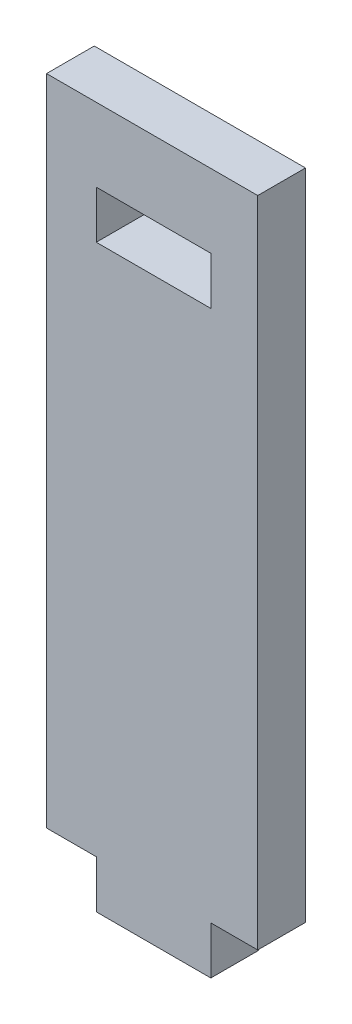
ISO-10303-21;
HEADER;
FILE_DESCRIPTION(('STEP AP214'),'2;1');
FILE_NAME('part.step','',(''),(''),'','','');
FILE_SCHEMA(('AUTOMOTIVE_DESIGN { 1 0 10303 214 1 1 1 1 }'));
ENDSEC;
DATA;
#1=APPLICATION_CONTEXT('core data for automotive mechanical design processes');
#2=APPLICATION_PROTOCOL_DEFINITION('international standard','automotive_design',2000,#1);
#3=PRODUCT_CONTEXT('',#1,'mechanical');
#4=PRODUCT('Part','Part','',(#3));
#5=PRODUCT_RELATED_PRODUCT_CATEGORY('part','',(#4));
#6=PRODUCT_DEFINITION_FORMATION('','',#4);
#7=PRODUCT_DEFINITION_CONTEXT('part definition',#1,'design');
#8=PRODUCT_DEFINITION('design','',#6,#7);
#9=PRODUCT_DEFINITION_SHAPE('','',#8);
#10=(LENGTH_UNIT() NAMED_UNIT(*) SI_UNIT(.MILLI.,.METRE.));
#11=(NAMED_UNIT(*) PLANE_ANGLE_UNIT() SI_UNIT($,.RADIAN.));
#12=(NAMED_UNIT(*) SI_UNIT($,.STERADIAN.) SOLID_ANGLE_UNIT());
#13=UNCERTAINTY_MEASURE_WITH_UNIT(LENGTH_MEASURE(1.E-05),#10,'distance_accuracy_value','');
#14=(GEOMETRIC_REPRESENTATION_CONTEXT(3) GLOBAL_UNCERTAINTY_ASSIGNED_CONTEXT((#13)) GLOBAL_UNIT_ASSIGNED_CONTEXT((#10,
#11,#12)) REPRESENTATION_CONTEXT('',''));
#15=CARTESIAN_POINT('',(0.,0.,0.));
#16=DIRECTION('',(0.,0.,1.));
#17=DIRECTION('',(1.,0.,0.));
#18=AXIS2_PLACEMENT_3D('',#15,#16,#17);
#19=CARTESIAN_POINT('',(0.,0.,5.));
#20=DIRECTION('',(0.,0.,1.));
#21=DIRECTION('',(1.,0.,0.));
#22=AXIS2_PLACEMENT_3D('',#19,#20,#21);
#23=PLANE('',#22);
#24=DIRECTION('',(0.,-1.,0.));
#25=VECTOR('',#24,1.);
#26=CARTESIAN_POINT('',(-17.479999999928,53.1273704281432,5.));
#27=LINE('',#26,#25);
#28=CARTESIAN_POINT('',(-17.479999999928,53.1273704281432,5.));
#29=VERTEX_POINT('',#28);
#30=CARTESIAN_POINT('',(-17.479999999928,-15.3125,5.));
#31=VERTEX_POINT('',#30);
#32=EDGE_CURVE('E162',#29,#31,#27,.T.);
#33=ORIENTED_EDGE('',*,*,#32,.T.);
#34=DIRECTION('',(1.,0.,0.));
#35=VECTOR('',#34,1.);
#36=CARTESIAN_POINT('',(-17.479999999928,-15.3125,5.));
#37=LINE('',#36,#35);
#38=CARTESIAN_POINT('',(-12.2699999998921,-15.3125,5.));
#39=VERTEX_POINT('',#38);
#40=EDGE_CURVE('E165',#31,#39,#37,.T.);
#41=ORIENTED_EDGE('',*,*,#40,.T.);
#42=DIRECTION('',(0.,-1.,0.));
#43=VECTOR('',#42,1.);
#44=CARTESIAN_POINT('',(-12.2699999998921,-15.3125,5.));
#45=LINE('',#44,#43);
#46=CARTESIAN_POINT('',(-12.2699999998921,-20.3125,5.));
#47=VERTEX_POINT('',#46);
#48=EDGE_CURVE('E168',#39,#47,#45,.T.);
#49=ORIENTED_EDGE('',*,*,#48,.T.);
#50=DIRECTION('',(1.,0.,0.));
#51=VECTOR('',#50,1.);
#52=CARTESIAN_POINT('',(-12.2699999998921,-20.3125,5.));
#53=LINE('',#52,#51);
#54=CARTESIAN_POINT('',(-0.269999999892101,-20.3125,5.));
#55=VERTEX_POINT('',#54);
#56=EDGE_CURVE('E170',#47,#55,#53,.T.);
#57=ORIENTED_EDGE('',*,*,#56,.T.);
#58=DIRECTION('',(0.,1.,0.));
#59=VECTOR('',#58,1.);
#60=CARTESIAN_POINT('',(-0.269999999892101,-20.3125,5.));
#61=LINE('',#60,#59);
#62=CARTESIAN_POINT('',(-0.269999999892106,-15.3125,5.));
#63=VERTEX_POINT('',#62);
#64=EDGE_CURVE('E172',#55,#63,#61,.T.);
#65=ORIENTED_EDGE('',*,*,#64,.T.);
#66=DIRECTION('',(1.,0.,0.));
#67=VECTOR('',#66,1.);
#68=CARTESIAN_POINT('',(-0.269999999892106,-15.3125,5.));
#69=LINE('',#68,#67);
#70=CARTESIAN_POINT('',(4.64500000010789,-15.3125,5.));
#71=VERTEX_POINT('',#70);
#72=EDGE_CURVE('E174',#63,#71,#69,.T.);
#73=ORIENTED_EDGE('',*,*,#72,.T.);
#74=DIRECTION('',(0.,1.,0.));
#75=VECTOR('',#74,1.);
#76=CARTESIAN_POINT('',(4.64500000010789,53.1273704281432,5.));
#77=LINE('',#76,#75);
#78=CARTESIAN_POINT('',(4.64500000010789,53.1273704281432,5.));
#79=VERTEX_POINT('',#78);
#80=EDGE_CURVE('E176',#71,#79,#77,.T.);
#81=ORIENTED_EDGE('',*,*,#80,.T.);
#82=DIRECTION('',(-1.,0.,0.));
#83=VECTOR('',#82,1.);
#84=CARTESIAN_POINT('',(-17.479999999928,53.1273704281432,5.));
#85=LINE('',#84,#83);
#86=EDGE_CURVE('E178',#79,#29,#85,.T.);
#87=ORIENTED_EDGE('',*,*,#86,.T.);
#88=EDGE_LOOP('',(#33,#41,#49,#57,#65,#73,#81,#87));
#89=FACE_BOUND('',#88,.T.);
#90=DIRECTION('',(1.,0.,0.));
#91=VECTOR('',#90,1.);
#92=CARTESIAN_POINT('',(-12.2699999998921,40.4298947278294,5.));
#93=LINE('',#92,#91);
#94=CARTESIAN_POINT('',(-12.2699999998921,40.4298947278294,5.));
#95=VERTEX_POINT('',#94);
#96=CARTESIAN_POINT('',(-0.269999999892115,40.4298947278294,5.));
#97=VERTEX_POINT('',#96);
#98=EDGE_CURVE('E134',#95,#97,#93,.T.);
#99=ORIENTED_EDGE('',*,*,#98,.F.);
#100=DIRECTION('',(0.,-1.,0.));
#101=VECTOR('',#100,1.);
#102=CARTESIAN_POINT('',(-12.2699999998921,45.4298947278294,5.));
#103=LINE('',#102,#101);
#104=CARTESIAN_POINT('',(-12.2699999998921,45.4298947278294,5.));
#105=VERTEX_POINT('',#104);
#106=EDGE_CURVE('E126',#105,#95,#103,.T.);
#107=ORIENTED_EDGE('',*,*,#106,.F.);
#108=DIRECTION('',(-1.,0.,0.));
#109=VECTOR('',#108,1.);
#110=CARTESIAN_POINT('',(-12.2699999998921,45.4298947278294,5.));
#111=LINE('',#110,#109);
#112=CARTESIAN_POINT('',(-0.269999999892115,45.4298947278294,5.));
#113=VERTEX_POINT('',#112);
#114=EDGE_CURVE('E148',#113,#105,#111,.T.);
#115=ORIENTED_EDGE('',*,*,#114,.F.);
#116=DIRECTION('',(0.,1.,0.));
#117=VECTOR('',#116,1.);
#118=CARTESIAN_POINT('',(-0.269999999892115,45.4298947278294,5.));
#119=LINE('',#118,#117);
#120=EDGE_CURVE('E146',#97,#113,#119,.T.);
#121=ORIENTED_EDGE('',*,*,#120,.F.);
#122=EDGE_LOOP('',(#99,#107,#115,#121));
#123=FACE_BOUND('',#122,.T.);
#124=ADVANCED_FACE('F37',(#89,#123),#23,.T.);
#125=CARTESIAN_POINT('',(0.,0.,0.));
#126=DIRECTION('',(0.,0.,1.));
#127=DIRECTION('',(1.,0.,0.));
#128=AXIS2_PLACEMENT_3D('',#125,#126,#127);
#129=PLANE('',#128);
#130=DIRECTION('',(0.,-1.,0.));
#131=VECTOR('',#130,1.);
#132=CARTESIAN_POINT('',(-17.479999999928,53.1273704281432,0.));
#133=LINE('',#132,#131);
#134=CARTESIAN_POINT('',(-17.479999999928,53.1273704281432,0.));
#135=VERTEX_POINT('',#134);
#136=CARTESIAN_POINT('',(-17.479999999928,-15.3125,0.));
#137=VERTEX_POINT('',#136);
#138=EDGE_CURVE('E142',#135,#137,#133,.T.);
#139=ORIENTED_EDGE('',*,*,#138,.F.);
#140=DIRECTION('',(-1.,0.,0.));
#141=VECTOR('',#140,1.);
#142=CARTESIAN_POINT('',(-17.479999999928,53.1273704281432,0.));
#143=LINE('',#142,#141);
#144=CARTESIAN_POINT('',(4.64500000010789,53.1273704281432,0.));
#145=VERTEX_POINT('',#144);
#146=EDGE_CURVE('E166',#145,#135,#143,.T.);
#147=ORIENTED_EDGE('',*,*,#146,.F.);
#148=DIRECTION('',(0.,1.,0.));
#149=VECTOR('',#148,1.);
#150=CARTESIAN_POINT('',(4.64500000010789,53.1273704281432,0.));
#151=LINE('',#150,#149);
#152=CARTESIAN_POINT('',(4.64500000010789,-15.3125,0.));
#153=VERTEX_POINT('',#152);
#154=EDGE_CURVE('E193',#153,#145,#151,.T.);
#155=ORIENTED_EDGE('',*,*,#154,.F.);
#156=DIRECTION('',(1.,0.,0.));
#157=VECTOR('',#156,1.);
#158=CARTESIAN_POINT('',(-0.269999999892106,-15.3125,0.));
#159=LINE('',#158,#157);
#160=CARTESIAN_POINT('',(-0.269999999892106,-15.3125,0.));
#161=VERTEX_POINT('',#160);
#162=EDGE_CURVE('E191',#161,#153,#159,.T.);
#163=ORIENTED_EDGE('',*,*,#162,.F.);
#164=DIRECTION('',(0.,1.,0.));
#165=VECTOR('',#164,1.);
#166=CARTESIAN_POINT('',(-0.269999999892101,-20.3125,0.));
#167=LINE('',#166,#165);
#168=CARTESIAN_POINT('',(-0.269999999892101,-20.3125,0.));
#169=VERTEX_POINT('',#168);
#170=EDGE_CURVE('E189',#169,#161,#167,.T.);
#171=ORIENTED_EDGE('',*,*,#170,.F.);
#172=DIRECTION('',(1.,0.,0.));
#173=VECTOR('',#172,1.);
#174=CARTESIAN_POINT('',(-12.2699999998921,-20.3125,0.));
#175=LINE('',#174,#173);
#176=CARTESIAN_POINT('',(-12.2699999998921,-20.3125,0.));
#177=VERTEX_POINT('',#176);
#178=EDGE_CURVE('E187',#177,#169,#175,.T.);
#179=ORIENTED_EDGE('',*,*,#178,.F.);
#180=DIRECTION('',(0.,-1.,0.));
#181=VECTOR('',#180,1.);
#182=CARTESIAN_POINT('',(-12.2699999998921,-15.3125,0.));
#183=LINE('',#182,#181);
#184=CARTESIAN_POINT('',(-12.2699999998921,-15.3125,0.));
#185=VERTEX_POINT('',#184);
#186=EDGE_CURVE('E185',#185,#177,#183,.T.);
#187=ORIENTED_EDGE('',*,*,#186,.F.);
#188=DIRECTION('',(1.,0.,0.));
#189=VECTOR('',#188,1.);
#190=CARTESIAN_POINT('',(-17.479999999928,-15.3125,0.));
#191=LINE('',#190,#189);
#192=EDGE_CURVE('E183',#137,#185,#191,.T.);
#193=ORIENTED_EDGE('',*,*,#192,.F.);
#194=EDGE_LOOP('',(#139,#147,#155,#163,#171,#179,#187,#193));
#195=FACE_BOUND('',#194,.T.);
#196=DIRECTION('',(0.,-1.,0.));
#197=VECTOR('',#196,1.);
#198=CARTESIAN_POINT('',(-12.2699999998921,45.4298947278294,0.));
#199=LINE('',#198,#197);
#200=CARTESIAN_POINT('',(-12.2699999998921,45.4298947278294,0.));
#201=VERTEX_POINT('',#200);
#202=CARTESIAN_POINT('',(-12.2699999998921,40.4298947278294,0.));
#203=VERTEX_POINT('',#202);
#204=EDGE_CURVE('E60',#201,#203,#199,.T.);
#205=ORIENTED_EDGE('',*,*,#204,.T.);
#206=DIRECTION('',(1.,0.,0.));
#207=VECTOR('',#206,1.);
#208=CARTESIAN_POINT('',(-12.2699999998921,40.4298947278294,0.));
#209=LINE('',#208,#207);
#210=CARTESIAN_POINT('',(-0.269999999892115,40.4298947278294,0.));
#211=VERTEX_POINT('',#210);
#212=EDGE_CURVE('E141',#203,#211,#209,.T.);
#213=ORIENTED_EDGE('',*,*,#212,.T.);
#214=DIRECTION('',(0.,1.,0.));
#215=VECTOR('',#214,1.);
#216=CARTESIAN_POINT('',(-0.269999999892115,45.4298947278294,0.));
#217=LINE('',#216,#215);
#218=CARTESIAN_POINT('',(-0.269999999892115,45.4298947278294,0.));
#219=VERTEX_POINT('',#218);
#220=EDGE_CURVE('E154',#211,#219,#217,.T.);
#221=ORIENTED_EDGE('',*,*,#220,.T.);
#222=DIRECTION('',(-1.,0.,0.));
#223=VECTOR('',#222,1.);
#224=CARTESIAN_POINT('',(-12.2699999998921,45.4298947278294,0.));
#225=LINE('',#224,#223);
#226=EDGE_CURVE('E135',#219,#201,#225,.T.);
#227=ORIENTED_EDGE('',*,*,#226,.T.);
#228=EDGE_LOOP('',(#205,#213,#221,#227));
#229=FACE_BOUND('',#228,.T.);
#230=ADVANCED_FACE('F223',(#195,#229),#129,.F.);
#231=CARTESIAN_POINT('',(-17.479999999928,53.1273704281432,5.));
#232=DIRECTION('',(1.,0.,0.));
#233=DIRECTION('',(0.,1.,0.));
#234=AXIS2_PLACEMENT_3D('',#231,#232,#233);
#235=PLANE('',#234);
#236=ORIENTED_EDGE('',*,*,#138,.T.);
#237=DIRECTION('',(0.,0.,-1.));
#238=VECTOR('',#237,1.);
#239=CARTESIAN_POINT('',(-17.479999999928,-15.3125,5.));
#240=LINE('',#239,#238);
#241=EDGE_CURVE('E11',#31,#137,#240,.T.);
#242=ORIENTED_EDGE('',*,*,#241,.F.);
#243=ORIENTED_EDGE('',*,*,#32,.F.);
#244=DIRECTION('',(0.,0.,-1.));
#245=VECTOR('',#244,1.);
#246=CARTESIAN_POINT('',(-17.479999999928,53.1273704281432,5.));
#247=LINE('',#246,#245);
#248=EDGE_CURVE('E180',#29,#135,#247,.T.);
#249=ORIENTED_EDGE('',*,*,#248,.T.);
#250=EDGE_LOOP('',(#236,#242,#243,#249));
#251=FACE_BOUND('',#250,.T.);
#252=ADVANCED_FACE('F39',(#251),#235,.F.);
#253=CARTESIAN_POINT('',(-17.479999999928,-15.3125,5.));
#254=DIRECTION('',(0.,1.,0.));
#255=DIRECTION('',(-1.,0.,0.));
#256=AXIS2_PLACEMENT_3D('',#253,#254,#255);
#257=PLANE('',#256);
#258=ORIENTED_EDGE('',*,*,#192,.T.);
#259=DIRECTION('',(0.,0.,-1.));
#260=VECTOR('',#259,1.);
#261=CARTESIAN_POINT('',(-12.2699999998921,-15.3125,5.));
#262=LINE('',#261,#260);
#263=EDGE_CURVE('E45',#39,#185,#262,.T.);
#264=ORIENTED_EDGE('',*,*,#263,.F.);
#265=ORIENTED_EDGE('',*,*,#40,.F.);
#266=ORIENTED_EDGE('',*,*,#241,.T.);
#267=EDGE_LOOP('',(#258,#264,#265,#266));
#268=FACE_BOUND('',#267,.T.);
#269=ADVANCED_FACE('F240',(#268),#257,.F.);
#270=CARTESIAN_POINT('',(-12.2699999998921,-15.3125,5.));
#271=DIRECTION('',(1.,0.,0.));
#272=DIRECTION('',(0.,1.,0.));
#273=AXIS2_PLACEMENT_3D('',#270,#271,#272);
#274=PLANE('',#273);
#275=ORIENTED_EDGE('',*,*,#186,.T.);
#276=DIRECTION('',(0.,0.,-1.));
#277=VECTOR('',#276,1.);
#278=CARTESIAN_POINT('',(-12.2699999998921,-20.3125,5.));
#279=LINE('',#278,#277);
#280=EDGE_CURVE('E210',#47,#177,#279,.T.);
#281=ORIENTED_EDGE('',*,*,#280,.F.);
#282=ORIENTED_EDGE('',*,*,#48,.F.);
#283=ORIENTED_EDGE('',*,*,#263,.T.);
#284=EDGE_LOOP('',(#275,#281,#282,#283));
#285=FACE_BOUND('',#284,.T.);
#286=ADVANCED_FACE('F217',(#285),#274,.F.);
#287=CARTESIAN_POINT('',(-12.2699999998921,-20.3125,5.));
#288=DIRECTION('',(0.,1.,0.));
#289=DIRECTION('',(-1.,0.,0.));
#290=AXIS2_PLACEMENT_3D('',#287,#288,#289);
#291=PLANE('',#290);
#292=ORIENTED_EDGE('',*,*,#178,.T.);
#293=DIRECTION('',(0.,0.,-1.));
#294=VECTOR('',#293,1.);
#295=CARTESIAN_POINT('',(-0.269999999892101,-20.3125,5.));
#296=LINE('',#295,#294);
#297=EDGE_CURVE('E207',#55,#169,#296,.T.);
#298=ORIENTED_EDGE('',*,*,#297,.F.);
#299=ORIENTED_EDGE('',*,*,#56,.F.);
#300=ORIENTED_EDGE('',*,*,#280,.T.);
#301=EDGE_LOOP('',(#292,#298,#299,#300));
#302=FACE_BOUND('',#301,.T.);
#303=ADVANCED_FACE('F229',(#302),#291,.F.);
#304=CARTESIAN_POINT('',(-0.269999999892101,-20.3125,5.));
#305=DIRECTION('',(-1.,0.,0.));
#306=DIRECTION('',(0.,-1.,0.));
#307=AXIS2_PLACEMENT_3D('',#304,#305,#306);
#308=PLANE('',#307);
#309=ORIENTED_EDGE('',*,*,#170,.T.);
#310=DIRECTION('',(0.,0.,-1.));
#311=VECTOR('',#310,1.);
#312=CARTESIAN_POINT('',(-0.269999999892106,-15.3125,5.));
#313=LINE('',#312,#311);
#314=EDGE_CURVE('E204',#63,#161,#313,.T.);
#315=ORIENTED_EDGE('',*,*,#314,.F.);
#316=ORIENTED_EDGE('',*,*,#64,.F.);
#317=ORIENTED_EDGE('',*,*,#297,.T.);
#318=EDGE_LOOP('',(#309,#315,#316,#317));
#319=FACE_BOUND('',#318,.T.);
#320=ADVANCED_FACE('F233',(#319),#308,.F.);
#321=CARTESIAN_POINT('',(-0.269999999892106,-15.3125,5.));
#322=DIRECTION('',(0.,1.,0.));
#323=DIRECTION('',(0.,0.,1.));
#324=AXIS2_PLACEMENT_3D('',#321,#322,#323);
#325=PLANE('',#324);
#326=ORIENTED_EDGE('',*,*,#162,.T.);
#327=DIRECTION('',(0.,0.,-1.));
#328=VECTOR('',#327,1.);
#329=CARTESIAN_POINT('',(4.64500000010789,-15.3125,5.));
#330=LINE('',#329,#328);
#331=EDGE_CURVE('E201',#71,#153,#330,.T.);
#332=ORIENTED_EDGE('',*,*,#331,.F.);
#333=ORIENTED_EDGE('',*,*,#72,.F.);
#334=ORIENTED_EDGE('',*,*,#314,.T.);
#335=EDGE_LOOP('',(#326,#332,#333,#334));
#336=FACE_BOUND('',#335,.T.);
#337=ADVANCED_FACE('F253',(#336),#325,.F.);
#338=CARTESIAN_POINT('',(4.64500000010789,53.1273704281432,5.));
#339=DIRECTION('',(-1.,0.,0.));
#340=DIRECTION('',(0.,-1.,0.));
#341=AXIS2_PLACEMENT_3D('',#338,#339,#340);
#342=PLANE('',#341);
#343=ORIENTED_EDGE('',*,*,#154,.T.);
#344=DIRECTION('',(0.,0.,-1.));
#345=VECTOR('',#344,1.);
#346=CARTESIAN_POINT('',(4.64500000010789,53.1273704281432,5.));
#347=LINE('',#346,#345);
#348=EDGE_CURVE('E198',#79,#145,#347,.T.);
#349=ORIENTED_EDGE('',*,*,#348,.F.);
#350=ORIENTED_EDGE('',*,*,#80,.F.);
#351=ORIENTED_EDGE('',*,*,#331,.T.);
#352=EDGE_LOOP('',(#343,#349,#350,#351));
#353=FACE_BOUND('',#352,.T.);
#354=ADVANCED_FACE('F251',(#353),#342,.F.);
#355=CARTESIAN_POINT('',(-17.479999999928,53.1273704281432,5.));
#356=DIRECTION('',(0.,-1.,0.));
#357=DIRECTION('',(0.,0.,-1.));
#358=AXIS2_PLACEMENT_3D('',#355,#356,#357);
#359=PLANE('',#358);
#360=ORIENTED_EDGE('',*,*,#146,.T.);
#361=ORIENTED_EDGE('',*,*,#248,.F.);
#362=ORIENTED_EDGE('',*,*,#86,.F.);
#363=ORIENTED_EDGE('',*,*,#348,.T.);
#364=EDGE_LOOP('',(#360,#361,#362,#363));
#365=FACE_BOUND('',#364,.T.);
#366=ADVANCED_FACE('F246',(#365),#359,.F.);
#367=CARTESIAN_POINT('',(-12.2699999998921,45.4298947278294,5.));
#368=DIRECTION('',(1.,0.,0.));
#369=DIRECTION('',(0.,0.,-1.));
#370=AXIS2_PLACEMENT_3D('',#367,#368,#369);
#371=PLANE('',#370);
#372=ORIENTED_EDGE('',*,*,#204,.F.);
#373=DIRECTION('',(0.,0.,-1.));
#374=VECTOR('',#373,1.);
#375=CARTESIAN_POINT('',(-12.2699999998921,45.4298947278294,5.));
#376=LINE('',#375,#374);
#377=EDGE_CURVE('E130',#105,#201,#376,.T.);
#378=ORIENTED_EDGE('',*,*,#377,.F.);
#379=ORIENTED_EDGE('',*,*,#106,.T.);
#380=DIRECTION('',(0.,0.,-1.));
#381=VECTOR('',#380,1.);
#382=CARTESIAN_POINT('',(-12.2699999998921,40.4298947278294,5.));
#383=LINE('',#382,#381);
#384=EDGE_CURVE('E129',#95,#203,#383,.T.);
#385=ORIENTED_EDGE('',*,*,#384,.T.);
#386=EDGE_LOOP('',(#372,#378,#379,#385));
#387=FACE_BOUND('',#386,.T.);
#388=ADVANCED_FACE('F128',(#387),#371,.T.);
#389=CARTESIAN_POINT('',(-12.2699999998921,40.4298947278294,5.));
#390=DIRECTION('',(0.,1.,0.));
#391=DIRECTION('',(0.,0.,1.));
#392=AXIS2_PLACEMENT_3D('',#389,#390,#391);
#393=PLANE('',#392);
#394=ORIENTED_EDGE('',*,*,#212,.F.);
#395=ORIENTED_EDGE('',*,*,#384,.F.);
#396=ORIENTED_EDGE('',*,*,#98,.T.);
#397=DIRECTION('',(0.,0.,-1.));
#398=VECTOR('',#397,1.);
#399=CARTESIAN_POINT('',(-0.269999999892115,40.4298947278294,5.));
#400=LINE('',#399,#398);
#401=EDGE_CURVE('E143',#97,#211,#400,.T.);
#402=ORIENTED_EDGE('',*,*,#401,.T.);
#403=EDGE_LOOP('',(#394,#395,#396,#402));
#404=FACE_BOUND('',#403,.T.);
#405=ADVANCED_FACE('F138',(#404),#393,.T.);
#406=CARTESIAN_POINT('',(-0.269999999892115,45.4298947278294,5.));
#407=DIRECTION('',(-1.,0.,0.));
#408=DIRECTION('',(0.,-1.,0.));
#409=AXIS2_PLACEMENT_3D('',#406,#407,#408);
#410=PLANE('',#409);
#411=ORIENTED_EDGE('',*,*,#220,.F.);
#412=ORIENTED_EDGE('',*,*,#401,.F.);
#413=ORIENTED_EDGE('',*,*,#120,.T.);
#414=DIRECTION('',(0.,0.,-1.));
#415=VECTOR('',#414,1.);
#416=CARTESIAN_POINT('',(-0.269999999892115,45.4298947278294,5.));
#417=LINE('',#416,#415);
#418=EDGE_CURVE('E52',#113,#219,#417,.T.);
#419=ORIENTED_EDGE('',*,*,#418,.T.);
#420=EDGE_LOOP('',(#411,#412,#413,#419));
#421=FACE_BOUND('',#420,.T.);
#422=ADVANCED_FACE('F278',(#421),#410,.T.);
#423=CARTESIAN_POINT('',(-12.2699999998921,45.4298947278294,5.));
#424=DIRECTION('',(0.,-1.,0.));
#425=DIRECTION('',(0.,0.,-1.));
#426=AXIS2_PLACEMENT_3D('',#423,#424,#425);
#427=PLANE('',#426);
#428=ORIENTED_EDGE('',*,*,#226,.F.);
#429=ORIENTED_EDGE('',*,*,#418,.F.);
#430=ORIENTED_EDGE('',*,*,#114,.T.);
#431=ORIENTED_EDGE('',*,*,#377,.T.);
#432=EDGE_LOOP('',(#428,#429,#430,#431));
#433=FACE_BOUND('',#432,.T.);
#434=ADVANCED_FACE('F282',(#433),#427,.T.);
#435=CLOSED_SHELL('',(#124,#230,#252,#269,#286,#303,#320,#337,#354,#366,#388,#405,#422,#434));
#436=MANIFOLD_SOLID_BREP('B2',#435);
#437=ADVANCED_BREP_SHAPE_REPRESENTATION('',(#18,#436),#14);
#438=SHAPE_DEFINITION_REPRESENTATION(#9,#437);
ENDSEC;
END-ISO-10303-21;
